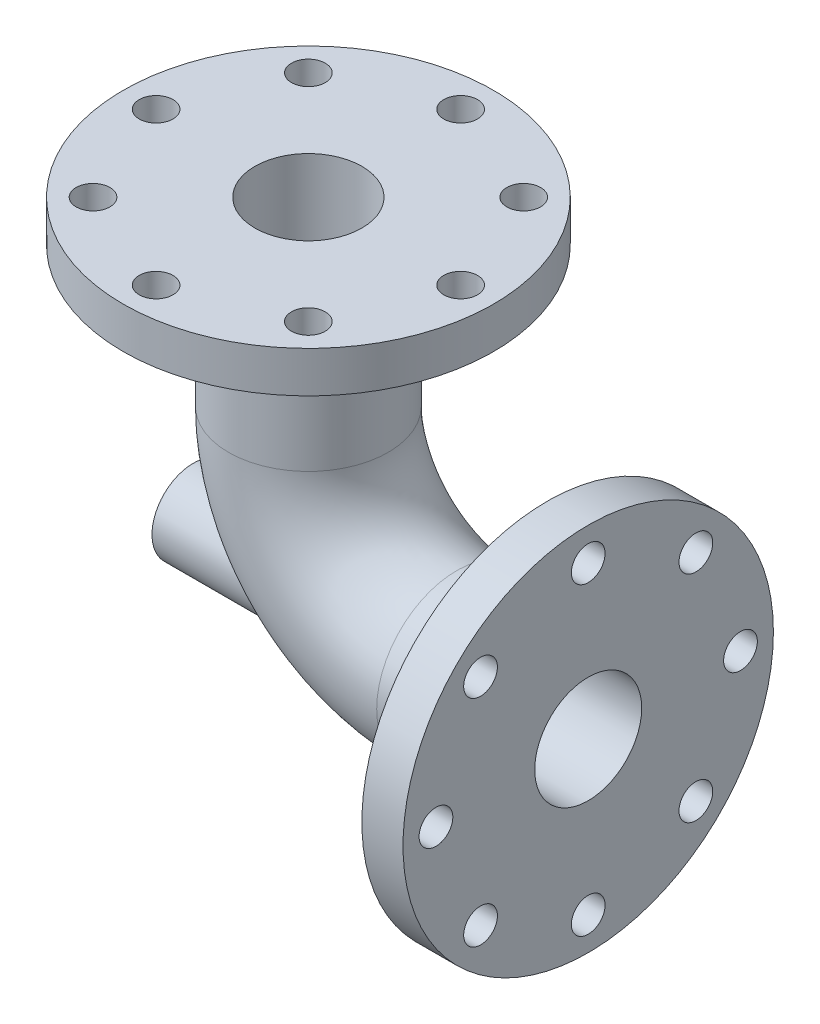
ISO-10303-21;
HEADER;
FILE_DESCRIPTION(('STEP AP214'),'2;1');
FILE_NAME('part.step','',(''),(''),'','','');
FILE_SCHEMA(('AUTOMOTIVE_DESIGN { 1 0 10303 214 1 1 1 1 }'));
ENDSEC;
DATA;
#1=APPLICATION_CONTEXT('core data for automotive mechanical design processes');
#2=APPLICATION_PROTOCOL_DEFINITION('international standard','automotive_design',2000,#1);
#3=PRODUCT_CONTEXT('',#1,'mechanical');
#4=PRODUCT('Part','Part','',(#3));
#5=PRODUCT_RELATED_PRODUCT_CATEGORY('part','',(#4));
#6=PRODUCT_DEFINITION_FORMATION('','',#4);
#7=PRODUCT_DEFINITION_CONTEXT('part definition',#1,'design');
#8=PRODUCT_DEFINITION('design','',#6,#7);
#9=PRODUCT_DEFINITION_SHAPE('','',#8);
#10=(LENGTH_UNIT() NAMED_UNIT(*) SI_UNIT(.MILLI.,.METRE.));
#11=(NAMED_UNIT(*) PLANE_ANGLE_UNIT() SI_UNIT($,.RADIAN.));
#12=(NAMED_UNIT(*) SI_UNIT($,.STERADIAN.) SOLID_ANGLE_UNIT());
#13=UNCERTAINTY_MEASURE_WITH_UNIT(LENGTH_MEASURE(1.E-05),#10,'distance_accuracy_value','');
#14=(GEOMETRIC_REPRESENTATION_CONTEXT(3) GLOBAL_UNCERTAINTY_ASSIGNED_CONTEXT((#13)) GLOBAL_UNIT_ASSIGNED_CONTEXT((#10,
#11,#12)) REPRESENTATION_CONTEXT('',''));
#15=CARTESIAN_POINT('',(0.,0.,0.));
#16=DIRECTION('',(0.,0.,1.));
#17=DIRECTION('',(1.,0.,0.));
#18=AXIS2_PLACEMENT_3D('',#15,#16,#17);
#19=CARTESIAN_POINT('',(90.,90.,0.));
#20=DIRECTION('',(0.,0.,1.));
#21=DIRECTION('',(1.,0.,0.));
#22=AXIS2_PLACEMENT_3D('',#19,#20,#21);
#23=TOROIDAL_SURFACE('',#22,90.,48.5);
#24=CARTESIAN_POINT('',(90.0000000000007,-1.05085693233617E-12,0.));
#25=DIRECTION('',(-1.,0.,0.));
#26=DIRECTION('',(0.,0.,1.));
#27=AXIS2_PLACEMENT_3D('',#24,#25,#26);
#28=CIRCLE('',#27,48.5);
#29=CARTESIAN_POINT('',(90.0000000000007,-1.05085693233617E-12,48.5));
#30=VERTEX_POINT('',#29);
#31=EDGE_CURVE('E62',#30,#30,#28,.T.);
#32=ORIENTED_EDGE('',*,*,#31,.T.);
#33=EDGE_LOOP('',(#32));
#34=FACE_BOUND('',#33,.T.);
#35=CARTESIAN_POINT('',(0.,90.0000000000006,0.));
#36=DIRECTION('',(0.,1.,0.));
#37=DIRECTION('',(0.,0.,1.));
#38=AXIS2_PLACEMENT_3D('',#35,#36,#37);
#39=CIRCLE('',#38,48.5);
#40=CARTESIAN_POINT('',(0.,90.0000000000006,48.5));
#41=VERTEX_POINT('',#40);
#42=EDGE_CURVE('E66',#41,#41,#39,.T.);
#43=ORIENTED_EDGE('',*,*,#42,.F.);
#44=EDGE_LOOP('',(#43));
#45=FACE_BOUND('',#44,.T.);
#46=CARTESIAN_POINT('',(0.155070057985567,-6.87591994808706,-24.0358425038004));
#47=CARTESIAN_POINT('',(0.717466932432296,-7.54686853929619,-23.8439036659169));
#48=CARTESIAN_POINT('',(1.26957468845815,-8.21791772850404,-23.6215535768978));
#49=CARTESIAN_POINT('',(2.34929979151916,-9.55565631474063,-23.1128027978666));
#50=CARTESIAN_POINT('',(2.87691357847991,-10.222345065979,-22.8263928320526));
#51=CARTESIAN_POINT('',(3.90344172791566,-11.5453961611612,-22.1865546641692));
#52=CARTESIAN_POINT('',(4.40236944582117,-12.2017632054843,-21.8331579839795));
#53=CARTESIAN_POINT('',(5.12610109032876,-13.1731239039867,-21.2511488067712));
#54=CARTESIAN_POINT('',(5.36322165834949,-13.4946938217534,-21.048506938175));
#55=CARTESIAN_POINT('',(5.82888081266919,-14.1326030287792,-20.6256153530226));
#56=CARTESIAN_POINT('',(6.05741719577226,-14.4489409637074,-20.4053611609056));
#57=CARTESIAN_POINT('',(6.64442320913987,-15.2696973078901,-19.8048424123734));
#58=CARTESIAN_POINT('',(6.99547999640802,-15.7689628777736,-19.4101271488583));
#59=CARTESIAN_POINT('',(7.67140049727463,-16.7455833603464,-18.5741364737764));
#60=CARTESIAN_POINT('',(7.9962692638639,-17.2229424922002,-18.1328700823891));
#61=CARTESIAN_POINT('',(8.61793849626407,-18.150413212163,-17.204443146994));
#62=CARTESIAN_POINT('',(8.91474515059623,-18.6005307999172,-16.717292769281));
#63=CARTESIAN_POINT('',(9.47862929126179,-19.4680105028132,-15.6985392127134));
#64=CARTESIAN_POINT('',(9.74570627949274,-19.8853720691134,-15.1669352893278));
#65=CARTESIAN_POINT('',(10.2501425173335,-20.6840980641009,-14.0583638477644));
#66=CARTESIAN_POINT('',(10.4873106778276,-21.0652275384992,-13.4811395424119));
#67=CARTESIAN_POINT('',(10.928710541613,-21.7829839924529,-12.2876549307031));
#68=CARTESIAN_POINT('',(11.1329415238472,-22.1196099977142,-11.6713937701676));
#69=CARTESIAN_POINT('',(11.5073589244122,-22.7430405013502,-10.4044434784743));
#70=CARTESIAN_POINT('',(11.6775533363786,-23.0298566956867,-9.75376247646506));
#71=CARTESIAN_POINT('',(11.9831257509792,-23.5490911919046,-8.42319034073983));
#72=CARTESIAN_POINT('',(12.1185077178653,-23.7815156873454,-7.74330254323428));
#73=CARTESIAN_POINT('',(12.3413458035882,-24.1664795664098,-6.43398877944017));
#74=CARTESIAN_POINT('',(12.4323676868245,-24.3248860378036,-5.80688626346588));
#75=CARTESIAN_POINT('',(12.585847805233,-24.5930429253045,-4.53894506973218));
#76=CARTESIAN_POINT('',(12.6483081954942,-24.7027970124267,-3.89810743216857));
#77=CARTESIAN_POINT('',(12.7444577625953,-24.8721111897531,-2.6079264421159));
#78=CARTESIAN_POINT('',(12.7781567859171,-24.9316884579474,-1.95858607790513));
#79=CARTESIAN_POINT('',(12.8167190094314,-24.9998841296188,-0.656382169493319));
#80=CARTESIAN_POINT('',(12.8215829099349,-25.0085037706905,-0.0035187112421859));
#81=CARTESIAN_POINT('',(12.8029931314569,-24.9756094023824,1.2643608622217));
#82=CARTESIAN_POINT('',(12.7810906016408,-24.9368415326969,1.87947334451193));
#83=CARTESIAN_POINT('',(12.7116025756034,-24.814218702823,3.10369888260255));
#84=CARTESIAN_POINT('',(12.6640183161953,-24.7303659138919,3.71281222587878));
#85=CARTESIAN_POINT('',(12.5433050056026,-24.5186227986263,4.92067552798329));
#86=CARTESIAN_POINT('',(12.4701791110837,-24.3907379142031,5.51942675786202));
#87=CARTESIAN_POINT('',(12.2985899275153,-24.0924909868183,6.70254179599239));
#88=CARTESIAN_POINT('',(12.2001262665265,-23.9221283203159,7.28690539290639));
#89=CARTESIAN_POINT('',(11.9780007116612,-23.5407029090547,8.43822266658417));
#90=CARTESIAN_POINT('',(11.8543025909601,-23.3295816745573,9.00514994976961));
#91=CARTESIAN_POINT('',(11.5822002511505,-22.8692972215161,10.1171822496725));
#92=CARTESIAN_POINT('',(11.4337962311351,-22.6201343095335,10.6622874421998));
#93=CARTESIAN_POINT('',(11.1127851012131,-22.0866104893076,11.7275979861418));
#94=CARTESIAN_POINT('',(10.9401763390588,-21.802247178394,12.2478016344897));
#95=CARTESIAN_POINT('',(10.571398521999,-21.2014854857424,13.2606082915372));
#96=CARTESIAN_POINT('',(10.3752287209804,-20.8850860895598,13.7532104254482));
#97=CARTESIAN_POINT('',(9.94937183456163,-20.2065252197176,14.7332842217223));
#98=CARTESIAN_POINT('',(9.71847747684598,-19.8428447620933,15.2191791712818));
#99=CARTESIAN_POINT('',(9.23251246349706,-19.0877892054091,16.1560616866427));
#100=CARTESIAN_POINT('',(8.97744117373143,-18.6964133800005,16.6070483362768));
#101=CARTESIAN_POINT('',(8.44427677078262,-17.8899656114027,17.4728118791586));
#102=CARTESIAN_POINT('',(8.16618133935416,-17.4748912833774,17.8875851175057));
#103=CARTESIAN_POINT('',(7.58827202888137,-16.6249801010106,18.6801434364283));
#104=CARTESIAN_POINT('',(7.28845539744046,-16.1901407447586,19.0579238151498));
#105=CARTESIAN_POINT('',(6.63363468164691,-15.2546214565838,19.8166313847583));
#106=CARTESIAN_POINT('',(6.27621686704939,-14.7520386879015,20.1931292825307));
#107=CARTESIAN_POINT('',(5.5383152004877,-13.7318475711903,20.9002792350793));
#108=CARTESIAN_POINT('',(5.15783023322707,-13.2142384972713,21.2309290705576));
#109=CARTESIAN_POINT('',(4.37570641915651,-12.1679704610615,21.8474119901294));
#110=CARTESIAN_POINT('',(3.97405614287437,-11.6393056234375,22.1332205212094));
#111=CARTESIAN_POINT('',(3.15183426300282,-10.5747841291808,22.6611342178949));
#112=CARTESIAN_POINT('',(2.73125908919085,-10.0389261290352,22.9032310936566));
#113=CARTESIAN_POINT('',(1.97845619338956,-9.09501765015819,23.2910591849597));
#114=CARTESIAN_POINT('',(1.64981293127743,-8.68780153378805,23.4458710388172));
#115=CARTESIAN_POINT('',(0.983938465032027,-7.87233368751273,23.7321102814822));
#116=CARTESIAN_POINT('',(0.646708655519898,-7.464082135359,23.8635414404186));
#117=CARTESIAN_POINT('',(-0.376965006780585,-6.23881705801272,24.2240039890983));
#118=CARTESIAN_POINT('',(-1.0752340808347,-5.42149245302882,24.4191236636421));
#119=CARTESIAN_POINT('',(-2.49737779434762,-3.79152703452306,24.7247495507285));
#120=CARTESIAN_POINT('',(-3.22129040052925,-2.97889543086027,24.8351243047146));
#121=CARTESIAN_POINT('',(-4.68768790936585,-1.36379867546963,24.9759287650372));
#122=CARTESIAN_POINT('',(-5.43017096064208,-0.561332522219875,25.006366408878));
#123=CARTESIAN_POINT('',(-6.94398344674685,1.04733836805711,24.9912743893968));
#124=CARTESIAN_POINT('',(-7.71559088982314,1.85326364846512,24.9441255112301));
#125=CARTESIAN_POINT('',(-9.26680880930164,3.44923195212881,24.7739148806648));
#126=CARTESIAN_POINT('',(-10.0464196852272,4.23927417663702,24.6508493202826));
#127=CARTESIAN_POINT('',(-11.6083151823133,5.80169623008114,24.3305646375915));
#128=CARTESIAN_POINT('',(-12.390600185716,6.57407340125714,24.1333344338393));
#129=CARTESIAN_POINT('',(-13.9522514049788,8.09914969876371,23.6651647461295));
#130=CARTESIAN_POINT('',(-14.7316177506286,8.85184970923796,23.3942285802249));
#131=CARTESIAN_POINT('',(-16.2785374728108,10.3323109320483,22.779010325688));
#132=CARTESIAN_POINT('',(-17.0461262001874,11.060161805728,22.4350337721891));
#133=CARTESIAN_POINT('',(-18.5665673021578,12.4912828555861,21.6708553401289));
#134=CARTESIAN_POINT('',(-19.3194174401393,13.1945493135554,21.2506419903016));
#135=CARTESIAN_POINT('',(-20.8019456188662,14.5713163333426,20.3312856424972));
#136=CARTESIAN_POINT('',(-21.5316514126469,15.2448529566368,19.8322418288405));
#137=CARTESIAN_POINT('',(-22.959739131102,16.5570329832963,18.750656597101));
#138=CARTESIAN_POINT('',(-23.6581362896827,17.1956933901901,18.1681563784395));
#139=CARTESIAN_POINT('',(-24.7767041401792,18.2151157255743,17.1329552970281));
#140=CARTESIAN_POINT('',(-25.2091299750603,18.6082918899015,16.7056127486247));
#141=CARTESIAN_POINT('',(-26.0521360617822,19.3733893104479,15.8119500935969));
#142=CARTESIAN_POINT('',(-26.4627174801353,19.7453117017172,15.3456320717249));
#143=CARTESIAN_POINT('',(-27.2569884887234,20.463763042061,14.3735588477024));
#144=CARTESIAN_POINT('',(-27.6407134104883,20.8103253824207,13.8678573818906));
#145=CARTESIAN_POINT('',(-28.3767034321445,21.4743027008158,12.8156623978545));
#146=CARTESIAN_POINT('',(-28.728965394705,21.7917147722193,12.2691648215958));
#147=CARTESIAN_POINT('',(-29.3230148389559,22.3265534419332,11.2594986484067));
#148=CARTESIAN_POINT('',(-29.5721316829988,22.5506804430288,10.8041833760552));
#149=CARTESIAN_POINT('',(-30.0440508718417,22.9750455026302,9.86967154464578));
#150=CARTESIAN_POINT('',(-30.2668677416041,23.1752967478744,9.39048837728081));
#151=CARTESIAN_POINT('',(-30.6829014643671,23.549055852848,8.40936763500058));
#152=CARTESIAN_POINT('',(-30.8761218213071,23.7225668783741,7.90743276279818));
#153=CARTESIAN_POINT('',(-31.2295292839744,24.0398391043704,6.88285373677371));
#154=CARTESIAN_POINT('',(-31.3897161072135,24.183600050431,6.36020940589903));
#155=CARTESIAN_POINT('',(-31.675149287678,24.4397172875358,5.29195946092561));
#156=CARTESIAN_POINT('',(-31.8000302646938,24.5517451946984,4.74617651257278));
#157=CARTESIAN_POINT('',(-32.0097078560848,24.7398211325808,3.6408067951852));
#158=CARTESIAN_POINT('',(-32.0945043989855,24.8158690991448,3.08122000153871));
#159=CARTESIAN_POINT('',(-32.22173381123,24.9299661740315,1.95384436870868));
#160=CARTESIAN_POINT('',(-32.2642008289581,24.9680459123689,1.38606251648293));
#161=CARTESIAN_POINT('',(-32.3056978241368,25.0052559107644,0.247677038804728));
#162=CARTESIAN_POINT('',(-32.3047342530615,25.0043919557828,-0.322926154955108));
#163=CARTESIAN_POINT('',(-32.2628739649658,24.9668560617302,-1.3746434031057));
#164=CARTESIAN_POINT('',(-32.2280514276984,24.9356308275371,-1.85621388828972));
#165=CARTESIAN_POINT('',(-32.1279082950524,24.8458257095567,-2.81353825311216));
#166=CARTESIAN_POINT('',(-32.0625915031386,24.7872492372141,-3.28929285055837));
#167=CARTESIAN_POINT('',(-31.9026966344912,24.6438370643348,-4.23185779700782));
#168=CARTESIAN_POINT('',(-31.8081152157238,24.5589983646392,-4.69866711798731));
#169=CARTESIAN_POINT('',(-31.5913740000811,24.364549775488,-5.62055947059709));
#170=CARTESIAN_POINT('',(-31.4692125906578,24.2549384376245,-6.07564181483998));
#171=CARTESIAN_POINT('',(-31.1975663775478,24.0111427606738,-6.97753560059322));
#172=CARTESIAN_POINT('',(-31.0477536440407,23.8766634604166,-7.42416808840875));
#173=CARTESIAN_POINT('',(-30.724114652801,23.5860595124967,-8.30128669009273));
#174=CARTESIAN_POINT('',(-30.5502890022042,23.4299354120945,-8.73177321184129));
#175=CARTESIAN_POINT('',(-29.9961300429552,22.9320147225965,-9.99720214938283));
#176=CARTESIAN_POINT('',(-29.5830490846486,22.5606108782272,-10.8063262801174));
#177=CARTESIAN_POINT('',(-28.4230152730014,21.5163418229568,-12.8048196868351));
#178=CARTESIAN_POINT('',(-27.622625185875,20.7946806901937,-13.9378008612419));
#179=CARTESIAN_POINT('',(-26.3329545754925,19.6278275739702,-15.4975033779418));
#180=CARTESIAN_POINT('',(-25.8873743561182,19.224049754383,-15.9948427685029));
#181=CARTESIAN_POINT('',(-24.971382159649,18.3922113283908,-16.9447519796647));
#182=CARTESIAN_POINT('',(-24.5009705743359,17.9641511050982,-17.3973225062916));
#183=CARTESIAN_POINT('',(-23.6706795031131,17.2066103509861,-18.1420261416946));
#184=CARTESIAN_POINT('',(-23.3154624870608,16.8819157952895,-18.4443598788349));
#185=CARTESIAN_POINT('',(-22.5959117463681,16.222735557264,-19.0267230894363));
#186=CARTESIAN_POINT('',(-22.2315774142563,15.8882492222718,-19.3067510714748));
#187=CARTESIAN_POINT('',(-21.1267501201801,14.8713663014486,-20.1144870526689));
#188=CARTESIAN_POINT('',(-20.3745563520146,14.1756582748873,-20.6097376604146));
#189=CARTESIAN_POINT('',(-18.8477306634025,12.7542409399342,-21.5184064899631));
#190=CARTESIAN_POINT('',(-18.0730707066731,12.0284936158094,-21.9317169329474));
#191=CARTESIAN_POINT('',(-16.5098299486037,10.551988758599,-22.6790644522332));
#192=CARTESIAN_POINT('',(-15.7212512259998,9.80123494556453,-23.0131132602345));
#193=CARTESIAN_POINT('',(-14.1073864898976,8.24946796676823,-23.6149152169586));
#194=CARTESIAN_POINT('',(-13.2818203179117,7.44762260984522,-23.8797646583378));
#195=CARTESIAN_POINT('',(-11.6292235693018,5.82251681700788,-24.3271165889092));
#196=CARTESIAN_POINT('',(-10.8021927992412,4.99925331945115,-24.509607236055));
#197=CARTESIAN_POINT('',(-9.15499724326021,3.33541243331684,-24.7908324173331));
#198=CARTESIAN_POINT('',(-8.33482141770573,2.49487671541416,-24.8897487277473));
#199=CARTESIAN_POINT('',(-6.7061053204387,0.797234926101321,-25.0017535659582));
#200=CARTESIAN_POINT('',(-5.89756106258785,-0.0598652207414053,-25.0148722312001));
#201=CARTESIAN_POINT('',(-4.64529915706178,-1.41312424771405,-24.9648320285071));
#202=CARTESIAN_POINT('',(-4.19530112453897,-1.90476426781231,-24.932260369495));
#203=CARTESIAN_POINT('',(-3.30248692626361,-2.89162161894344,-24.8371547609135));
#204=CARTESIAN_POINT('',(-2.8596699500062,-3.38683853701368,-24.774624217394));
#205=CARTESIAN_POINT('',(-1.9822842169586,-4.38024938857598,-24.618415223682));
#206=CARTESIAN_POINT('',(-1.5477207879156,-4.8784449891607,-24.5247173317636));
#207=CARTESIAN_POINT('',(-0.688510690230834,-5.87638161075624,-24.3049222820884));
#208=CARTESIAN_POINT('',(-0.263865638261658,-6.37612286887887,-24.1788198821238));
#209=CARTESIAN_POINT('',(0.155070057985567,-6.87591994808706,-24.0358425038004));
#210=B_SPLINE_CURVE_WITH_KNOTS('',3,(#46,#47,#48,#49,#50,#51,#52,#53,#54,#55,#56,#57,#58,#59,
#60,#61,#62,#63,#64,#65,#66,#67,#68,#69,#70,#71,#72,#73,#74,#75,#76,#77,#78,#79,#80,#81,#82,#83,
#84,#85,#86,#87,#88,#89,#90,#91,#92,#93,#94,#95,#96,#97,#98,#99,#100,#101,#102,#103,#104,#105,
#106,#107,#108,#109,#110,#111,#112,#113,#114,#115,#116,#117,#118,#119,#120,#121,#122,#123,#124,
#125,#126,#127,#128,#129,#130,#131,#132,#133,#134,#135,#136,#137,#138,#139,#140,#141,#142,#143,
#144,#145,#146,#147,#148,#149,#150,#151,#152,#153,#154,#155,#156,#157,#158,#159,#160,#161,#162,
#163,#164,#165,#166,#167,#168,#169,#170,#171,#172,#173,#174,#175,#176,#177,#178,#179,#180,#181,
#182,#183,#184,#185,#186,#187,#188,#189,#190,#191,#192,#193,#194,#195,#196,#197,#198,#199,#200,
#201,#202,#203,#204,#205,#206,#207,#208,#209),.UNSPECIFIED.,.T.,.F.,(4,2,2,2,2,2,2,2,2,2,2,2,2,
2,2,2,2,2,2,2,2,2,2,2,2,2,2,2,2,2,2,2,2,2,2,2,2,2,2,2,2,2,2,2,2,2,2,2,2,2,2,2,2,2,2,2,2,2,2,2,2,
2,2,2,2,2,2,2,2,2,2,2,2,2,2,2,2,2,2,2,2,4),(0.,2.68836013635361,5.37710979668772,
8.06459734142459,9.40818183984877,10.7521088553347,12.9303384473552,15.1081467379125,
17.2854736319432,19.4628370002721,21.6534738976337,23.8441587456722,26.0343284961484,
28.2242487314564,30.1812636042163,32.138130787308,34.0943277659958,36.0504772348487,
37.8984473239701,39.7463284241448,41.593981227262,43.4416611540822,45.2920125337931,
47.1423490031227,48.9928118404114,50.8433332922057,52.7893548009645,54.7354273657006,
56.6816961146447,58.6282119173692,60.7937589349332,62.9594107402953,65.126244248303,
67.2934882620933,68.9300418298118,70.5663312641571,73.8397097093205,77.1181557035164,
80.3962761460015,83.7436817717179,87.091255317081,90.43932924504,93.7872524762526,
97.1214375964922,100.456124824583,103.786649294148,107.115535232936,109.286145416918,
111.456639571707,113.624222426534,115.792021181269,117.486578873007,119.180196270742,
120.873613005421,122.567044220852,124.277407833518,125.987774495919,127.696760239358,
129.40549211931,130.855258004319,132.304843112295,133.754593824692,135.204429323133,
136.672715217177,138.140963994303,141.076778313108,145.73999390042,148.079653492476,
150.419276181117,152.123742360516,153.828322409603,157.238079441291,160.65229211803,
164.0659991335,167.60576776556,171.146045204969,174.678602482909,178.209918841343,
180.211161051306,182.212175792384,184.214441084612,186.217030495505),.UNSPECIFIED.);
#211=CARTESIAN_POINT('',(0.155070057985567,-6.87591994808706,-24.0358425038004));
#212=VERTEX_POINT('',#211);
#213=EDGE_CURVE('E11',#212,#212,#210,.T.);
#214=ORIENTED_EDGE('',*,*,#213,.F.);
#215=EDGE_LOOP('',(#214));
#216=FACE_BOUND('',#215,.T.);
#217=ADVANCED_FACE('F49',(#34,#45,#216),#23,.T.);
#218=CARTESIAN_POINT('',(0.,175.,0.));
#219=DIRECTION('',(0.,-1.,0.));
#220=DIRECTION('',(0.,0.,-1.));
#221=AXIS2_PLACEMENT_3D('',#218,#219,#220);
#222=CYLINDRICAL_SURFACE('',#221,48.5);
#223=ORIENTED_EDGE('',*,*,#42,.T.);
#224=EDGE_LOOP('',(#223));
#225=FACE_BOUND('',#224,.T.);
#226=CARTESIAN_POINT('',(0.,175.,0.));
#227=DIRECTION('',(0.,1.,0.));
#228=DIRECTION('',(0.,0.,1.));
#229=AXIS2_PLACEMENT_3D('',#226,#227,#228);
#230=CIRCLE('',#229,48.5);
#231=CARTESIAN_POINT('',(0.,175.,48.5));
#232=VERTEX_POINT('',#231);
#233=EDGE_CURVE('E197',#232,#232,#230,.T.);
#234=ORIENTED_EDGE('',*,*,#233,.F.);
#235=EDGE_LOOP('',(#234));
#236=FACE_BOUND('',#235,.T.);
#237=ADVANCED_FACE('F183',(#225,#236),#222,.T.);
#238=CARTESIAN_POINT('',(90.0000000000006,0.,0.));
#239=DIRECTION('',(1.,0.,0.));
#240=DIRECTION('',(0.,0.,-1.));
#241=AXIS2_PLACEMENT_3D('',#238,#239,#240);
#242=CYLINDRICAL_SURFACE('',#241,48.5);
#243=CARTESIAN_POINT('',(145.,0.,0.));
#244=DIRECTION('',(-1.,0.,0.));
#245=DIRECTION('',(0.,0.,1.));
#246=AXIS2_PLACEMENT_3D('',#243,#244,#245);
#247=CIRCLE('',#246,48.5);
#248=CARTESIAN_POINT('',(145.,0.,48.5));
#249=VERTEX_POINT('',#248);
#250=EDGE_CURVE('E73',#249,#249,#247,.T.);
#251=ORIENTED_EDGE('',*,*,#250,.T.);
#252=EDGE_LOOP('',(#251));
#253=FACE_BOUND('',#252,.T.);
#254=ORIENTED_EDGE('',*,*,#31,.F.);
#255=EDGE_LOOP('',(#254));
#256=FACE_BOUND('',#255,.T.);
#257=ADVANCED_FACE('F51',(#253,#256),#242,.T.);
#258=CARTESIAN_POINT('',(0.,175.,0.));
#259=DIRECTION('',(0.,-1.,0.));
#260=DIRECTION('',(0.,0.,-1.));
#261=AXIS2_PLACEMENT_3D('',#258,#259,#260);
#262=CYLINDRICAL_SURFACE('',#261,32.5);
#263=CARTESIAN_POINT('',(0.,90.0000000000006,0.));
#264=DIRECTION('',(0.,-1.,0.));
#265=DIRECTION('',(0.,0.,-1.));
#266=AXIS2_PLACEMENT_3D('',#263,#264,#265);
#267=CIRCLE('',#266,32.5);
#268=CARTESIAN_POINT('',(0.,90.0000000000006,-32.5));
#269=VERTEX_POINT('',#268);
#270=EDGE_CURVE('E203',#269,#269,#267,.F.);
#271=ORIENTED_EDGE('',*,*,#270,.F.);
#272=EDGE_LOOP('',(#271));
#273=FACE_BOUND('',#272,.T.);
#274=CARTESIAN_POINT('',(0.,200.,0.));
#275=DIRECTION('',(0.,1.,0.));
#276=DIRECTION('',(0.,0.,1.));
#277=AXIS2_PLACEMENT_3D('',#274,#275,#276);
#278=CIRCLE('',#277,32.5);
#279=CARTESIAN_POINT('',(0.,200.,32.5));
#280=VERTEX_POINT('',#279);
#281=EDGE_CURVE('E212',#280,#280,#278,.T.);
#282=ORIENTED_EDGE('',*,*,#281,.T.);
#283=EDGE_LOOP('',(#282));
#284=FACE_BOUND('',#283,.T.);
#285=ADVANCED_FACE('F167',(#273,#284),#262,.F.);
#286=CARTESIAN_POINT('',(90.,90.,0.));
#287=DIRECTION('',(0.,0.,1.));
#288=DIRECTION('',(1.,0.,0.));
#289=AXIS2_PLACEMENT_3D('',#286,#287,#288);
#290=TOROIDAL_SURFACE('',#289,90.,32.5);
#291=CARTESIAN_POINT('',(-1.55503250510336,9.03875048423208,-4.27796560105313));
#292=CARTESIAN_POINT('',(-1.7414521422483,9.18684291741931,-3.96503310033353));
#293=CARTESIAN_POINT('',(-1.9124105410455,9.32236996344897,-3.63661544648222));
#294=CARTESIAN_POINT('',(-2.13898067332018,9.50175106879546,-3.1224657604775));
#295=CARTESIAN_POINT('',(-2.20956256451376,9.55758858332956,-2.94737357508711));
#296=CARTESIAN_POINT('',(-2.33958622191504,9.66039232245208,-2.5906052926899));
#297=CARTESIAN_POINT('',(-2.39903274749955,9.70736233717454,-2.40893204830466));
#298=CARTESIAN_POINT('',(-2.50613906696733,9.7919519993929,-2.03817298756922));
#299=CARTESIAN_POINT('',(-2.55369009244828,9.82948537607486,-1.84903586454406));
#300=CARTESIAN_POINT('',(-2.63526598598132,9.89385531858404,-1.46605566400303));
#301=CARTESIAN_POINT('',(-2.66929088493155,9.92069190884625,-1.27221259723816));
#302=CARTESIAN_POINT('',(-2.72295327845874,9.96300964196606,-0.881484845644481));
#303=CARTESIAN_POINT('',(-2.74260362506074,9.97850092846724,-0.684603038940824));
#304=CARTESIAN_POINT('',(-2.76704741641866,9.99777028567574,-0.289351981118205));
#305=CARTESIAN_POINT('',(-2.77184214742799,10.0015493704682,-0.0909828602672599));
#306=CARTESIAN_POINT('',(-2.7666868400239,9.99748569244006,0.288188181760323));
#307=CARTESIAN_POINT('',(-2.75798119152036,9.99062376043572,0.469019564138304));
#308=CARTESIAN_POINT('',(-2.72828069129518,9.96720884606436,0.82902421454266));
#309=CARTESIAN_POINT('',(-2.70728657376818,9.95065644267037,1.0081975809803));
#310=CARTESIAN_POINT('',(-2.65345402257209,9.90820046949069,1.36367976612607));
#311=CARTESIAN_POINT('',(-2.62061169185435,9.88229382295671,1.53998762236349));
#312=CARTESIAN_POINT('',(-2.54374650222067,9.8216364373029,1.88858821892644));
#313=CARTESIAN_POINT('',(-2.4997231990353,9.78688534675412,2.06088079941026));
#314=CARTESIAN_POINT('',(-2.40147275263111,9.70928894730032,2.39996982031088));
#315=CARTESIAN_POINT('',(-2.34728156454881,9.6664721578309,2.56678326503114));
#316=CARTESIAN_POINT('',(-2.22946273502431,9.5733263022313,2.89491566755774));
#317=CARTESIAN_POINT('',(-2.16583214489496,9.52299488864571,3.0562328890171));
#318=CARTESIAN_POINT('',(-1.96216364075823,9.36178180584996,3.53110792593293));
#319=CARTESIAN_POINT('',(-1.80930375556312,9.24064561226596,3.83574073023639));
#320=CARTESIAN_POINT('',(-1.36977724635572,8.89169016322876,4.60585715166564));
#321=CARTESIAN_POINT('',(-1.06002883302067,8.64516664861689,5.04971859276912));
#322=CARTESIAN_POINT('',(-0.558782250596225,8.24462528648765,5.66447943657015));
#323=CARTESIAN_POINT('',(-0.385250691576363,8.10570770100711,5.86120217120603));
#324=CARTESIAN_POINT('',(-0.0279841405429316,7.81909004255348,6.2384183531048));
#325=CARTESIAN_POINT('',(0.15575053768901,7.67139023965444,6.41891229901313));
#326=CARTESIAN_POINT('',(0.633215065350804,7.28665882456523,6.85784635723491));
#327=CARTESIAN_POINT('',(0.932660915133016,7.04454011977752,7.10560740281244));
#328=CARTESIAN_POINT('',(1.54608016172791,6.54647088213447,7.56696633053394));
#329=CARTESIAN_POINT('',(1.86006120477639,6.29051305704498,7.78054596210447));
#330=CARTESIAN_POINT('',(2.49907798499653,5.76712690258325,8.17606140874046));
#331=CARTESIAN_POINT('',(2.82412930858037,5.49968224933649,8.3579501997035));
#332=CARTESIAN_POINT('',(3.48184291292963,4.95568829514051,8.69154324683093));
#333=CARTESIAN_POINT('',(3.81450467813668,4.67913961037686,8.84324954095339));
#334=CARTESIAN_POINT('',(4.60781727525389,4.01581982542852,9.16815710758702));
#335=CARTESIAN_POINT('',(5.07079688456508,3.62571530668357,9.32893988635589));
#336=CARTESIAN_POINT('',(6.00204236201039,2.83400273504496,9.59913563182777));
#337=CARTESIAN_POINT('',(6.4703102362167,2.43239022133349,9.70852838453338));
#338=CARTESIAN_POINT('',(7.40814204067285,1.61998513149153,9.87662553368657));
#339=CARTESIAN_POINT('',(7.87770621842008,1.20919067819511,9.93531946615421));
#340=CARTESIAN_POINT('',(8.81425190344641,0.380780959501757,10.0013801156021));
#341=CARTESIAN_POINT('',(9.28123414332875,-0.0368322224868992,10.0087622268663));
#342=CARTESIAN_POINT('',(10.1280675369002,-0.803287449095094,9.97371978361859));
#343=CARTESIAN_POINT('',(10.5089163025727,-1.15142678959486,9.93975362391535));
#344=CARTESIAN_POINT('',(11.2641423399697,-1.84910995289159,9.83388486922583));
#345=CARTESIAN_POINT('',(11.638519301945,-2.19865384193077,9.76198046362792));
#346=CARTESIAN_POINT('',(12.3775018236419,-2.89632442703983,9.57816422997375));
#347=CARTESIAN_POINT('',(12.7421230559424,-3.24445252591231,9.46632130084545));
#348=CARTESIAN_POINT('',(13.4590950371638,-3.93693661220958,9.19989551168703));
#349=CARTESIAN_POINT('',(13.8114506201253,-4.28129404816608,9.0453297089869));
#350=CARTESIAN_POINT('',(14.3941604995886,-4.8575254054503,8.74500356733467));
#351=CARTESIAN_POINT('',(14.628700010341,-5.09141348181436,8.61116232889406));
#352=CARTESIAN_POINT('',(15.0886332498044,-5.55385908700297,8.32041089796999));
#353=CARTESIAN_POINT('',(15.3140274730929,-5.78241690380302,8.16350195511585));
#354=CARTESIAN_POINT('',(15.7536792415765,-6.23190077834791,7.82574977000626));
#355=CARTESIAN_POINT('',(15.9679484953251,-6.4528347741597,7.64493243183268));
#356=CARTESIAN_POINT('',(16.3836335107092,-6.88489156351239,7.25825703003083));
#357=CARTESIAN_POINT('',(16.5850478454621,-7.09601326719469,7.05239619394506));
#358=CARTESIAN_POINT('',(16.9296329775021,-7.45998734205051,6.66355261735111));
#359=CARTESIAN_POINT('',(17.0758180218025,-7.61538273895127,6.4856130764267));
#360=CARTESIAN_POINT('',(17.3576832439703,-7.91672887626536,6.11412933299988));
#361=CARTESIAN_POINT('',(17.493365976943,-8.06268191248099,5.92058894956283));
#362=CARTESIAN_POINT('',(17.7527993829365,-8.34325411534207,5.51817248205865));
#363=CARTESIAN_POINT('',(17.8765594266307,-8.47788217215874,5.30930867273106));
#364=CARTESIAN_POINT('',(18.1108169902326,-8.73396229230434,4.87658402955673));
#365=CARTESIAN_POINT('',(18.2213166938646,-8.85541652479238,4.65272567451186));
#366=CARTESIAN_POINT('',(18.4102403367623,-9.0639704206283,4.22969713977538));
#367=CARTESIAN_POINT('',(18.4909346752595,-9.15341425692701,4.03269337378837));
#368=CARTESIAN_POINT('',(18.6412500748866,-9.32055995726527,3.62970029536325));
#369=CARTESIAN_POINT('',(18.7108732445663,-9.39826405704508,3.42371270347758));
#370=CARTESIAN_POINT('',(18.8382213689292,-9.5407741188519,3.00379326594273));
#371=CARTESIAN_POINT('',(18.895949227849,-9.60558322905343,2.78986337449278));
#372=CARTESIAN_POINT('',(18.9987824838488,-9.72127486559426,2.35528542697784));
#373=CARTESIAN_POINT('',(19.0438876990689,-9.77215719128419,2.13463727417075));
#374=CARTESIAN_POINT('',(19.1210302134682,-9.85931118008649,1.68707055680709));
#375=CARTESIAN_POINT('',(19.1530030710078,-9.89551078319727,1.46012677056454));
#376=CARTESIAN_POINT('',(19.2030863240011,-9.95226373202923,1.00276721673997));
#377=CARTESIAN_POINT('',(19.2211966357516,-9.97281698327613,0.772351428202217));
#378=CARTESIAN_POINT('',(19.2432708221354,-9.99787356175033,0.310015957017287));
#379=CARTESIAN_POINT('',(19.2472374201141,-10.0023799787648,0.0780965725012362));
#380=CARTESIAN_POINT('',(19.2409678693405,-9.9952606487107,-0.385292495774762));
#381=CARTESIAN_POINT('',(19.2307325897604,-9.98363588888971,-0.616762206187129));
#382=CARTESIAN_POINT('',(19.1976396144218,-9.94609421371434,-1.05841333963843));
#383=CARTESIAN_POINT('',(19.1758841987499,-9.9214256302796,-1.26878583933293));
#384=CARTESIAN_POINT('',(19.1208266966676,-9.85909405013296,-1.68604768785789));
#385=CARTESIAN_POINT('',(19.0875253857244,-9.82143192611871,-1.89293726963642));
#386=CARTESIAN_POINT('',(19.009796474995,-9.73370778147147,-2.3018822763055));
#387=CARTESIAN_POINT('',(18.9653711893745,-9.6836483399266,-2.5039386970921));
#388=CARTESIAN_POINT('',(18.8658921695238,-9.57184025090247,-2.90218367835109));
#389=CARTESIAN_POINT('',(18.8108344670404,-9.51008723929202,-3.09837001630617));
#390=CARTESIAN_POINT('',(18.6886446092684,-9.37344924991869,-3.49041578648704));
#391=CARTESIAN_POINT('',(18.6211642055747,-9.29818770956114,-3.68603506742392));
#392=CARTESIAN_POINT('',(18.4761767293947,-9.1370515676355,-4.06908922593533));
#393=CARTESIAN_POINT('',(18.3986657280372,-9.0511728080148,-4.25652085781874));
#394=CARTESIAN_POINT('',(18.2343721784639,-8.86985092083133,-4.62249420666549));
#395=CARTESIAN_POINT('',(18.1475886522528,-8.7744067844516,-4.80103498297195));
#396=CARTESIAN_POINT('',(17.9654955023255,-8.57498265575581,-5.14877335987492));
#397=CARTESIAN_POINT('',(17.8701841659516,-8.47100094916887,-5.3179690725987));
#398=CARTESIAN_POINT('',(17.6281211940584,-8.20809908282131,-5.71901765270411));
#399=CARTESIAN_POINT('',(17.4771785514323,-8.04512609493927,-5.94570877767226));
#400=CARTESIAN_POINT('',(17.1611822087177,-7.70631791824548,-6.37873893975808));
#401=CARTESIAN_POINT('',(16.996123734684,-7.53047838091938,-6.58507104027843));
#402=CARTESIAN_POINT('',(16.6535151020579,-7.16813533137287,-6.97777361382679));
#403=CARTESIAN_POINT('',(16.4759449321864,-6.98161482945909,-7.16411084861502));
#404=CARTESIAN_POINT('',(16.1102514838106,-6.60034232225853,-7.51684415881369));
#405=CARTESIAN_POINT('',(15.922127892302,-6.40559007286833,-7.68323964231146));
#406=CARTESIAN_POINT('',(15.4643275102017,-5.93522776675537,-8.05566856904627));
#407=CARTESIAN_POINT('',(15.1905772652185,-5.65674232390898,-8.25308956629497));
#408=CARTESIAN_POINT('',(14.6291393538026,-5.09153631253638,-8.61328249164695));
#409=CARTESIAN_POINT('',(14.3414466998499,-4.80481281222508,-8.77604190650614));
#410=CARTESIAN_POINT('',(13.7545900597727,-4.22591360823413,-9.06901288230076));
#411=CARTESIAN_POINT('',(13.4554142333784,-3.93373244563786,-9.19918974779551));
#412=CARTESIAN_POINT('',(12.8481912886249,-3.34660118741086,-9.42865881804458));
#413=CARTESIAN_POINT('',(12.5401441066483,-3.05165107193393,-9.52795080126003));
#414=CARTESIAN_POINT('',(11.8051419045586,-2.35463988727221,-9.72780773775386));
#415=CARTESIAN_POINT('',(11.3752108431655,-1.95215013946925,-9.81602568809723));
#416=CARTESIAN_POINT('',(10.5064748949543,-1.14878775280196,-9.94211653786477));
#417=CARTESIAN_POINT('',(10.0676668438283,-0.747915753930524,-9.9799711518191));
#418=CARTESIAN_POINT('',(9.18403975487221,0.0502122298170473,-10.0078553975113));
#419=CARTESIAN_POINT('',(8.73921218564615,0.447461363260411,-9.99780802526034));
#420=CARTESIAN_POINT('',(7.84751765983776,1.23555014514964,-9.93125297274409));
#421=CARTESIAN_POINT('',(7.40065100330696,1.62639070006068,-9.87475192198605));
#422=CARTESIAN_POINT('',(6.50037658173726,2.4064272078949,-9.71443961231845));
#423=CARTESIAN_POINT('',(6.04698648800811,2.79548272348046,-9.60984185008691));
#424=CARTESIAN_POINT('',(5.14476658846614,3.56310058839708,-9.35244752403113));
#425=CARTESIAN_POINT('',(4.69593813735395,3.94165987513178,-9.19963705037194));
#426=CARTESIAN_POINT('',(3.80767402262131,4.68523094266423,-8.84410854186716));
#427=CARTESIAN_POINT('',(3.36822683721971,5.05025980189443,-8.64145607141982));
#428=CARTESIAN_POINT('',(2.7201193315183,5.58510597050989,-8.29767416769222));
#429=CARTESIAN_POINT('',(2.50596759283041,5.76123910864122,-8.17647353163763));
#430=CARTESIAN_POINT('',(2.08216045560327,6.10874349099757,-7.92021908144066));
#431=CARTESIAN_POINT('',(1.87250434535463,6.28011549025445,-7.78516747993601));
#432=CARTESIAN_POINT('',(1.42524228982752,6.64467563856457,-7.47756652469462));
#433=CARTESIAN_POINT('',(1.18859387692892,6.83691469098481,-7.30248421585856));
#434=CARTESIAN_POINT('',(0.724682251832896,7.21265883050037,-6.93161160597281));
#435=CARTESIAN_POINT('',(0.497419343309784,7.39616363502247,-6.73582063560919));
#436=CARTESIAN_POINT('',(0.0557711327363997,7.75183870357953,-6.32320025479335));
#437=CARTESIAN_POINT('',(-0.158666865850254,7.92405567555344,-6.10646811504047));
#438=CARTESIAN_POINT('',(-0.57247040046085,8.25562272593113,-5.6501473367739));
#439=CARTESIAN_POINT('',(-0.771844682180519,8.41498027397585,-5.41057214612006));
#440=CARTESIAN_POINT('',(-1.17227731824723,8.73441317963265,-4.8801678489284));
#441=CARTESIAN_POINT('',(-1.37117453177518,8.89269304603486,-4.58659797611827));
#442=CARTESIAN_POINT('',(-1.55503250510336,9.03875048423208,-4.27796560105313));
#443=B_SPLINE_CURVE_WITH_KNOTS('',3,(#291,#292,#293,#294,#295,#296,#297,#298,#299,#300,#301,
#302,#303,#304,#305,#306,#307,#308,#309,#310,#311,#312,#313,#314,#315,#316,#317,#318,#319,#320,
#321,#322,#323,#324,#325,#326,#327,#328,#329,#330,#331,#332,#333,#334,#335,#336,#337,#338,#339,
#340,#341,#342,#343,#344,#345,#346,#347,#348,#349,#350,#351,#352,#353,#354,#355,#356,#357,#358,
#359,#360,#361,#362,#363,#364,#365,#366,#367,#368,#369,#370,#371,#372,#373,#374,#375,#376,#377,
#378,#379,#380,#381,#382,#383,#384,#385,#386,#387,#388,#389,#390,#391,#392,#393,#394,#395,#396,
#397,#398,#399,#400,#401,#402,#403,#404,#405,#406,#407,#408,#409,#410,#411,#412,#413,#414,#415,
#416,#417,#418,#419,#420,#421,#422,#423,#424,#425,#426,#427,#428,#429,#430,#431,#432,#433,#434,
#435,#436,#437,#438,#439,#440,#441,#442),.UNSPECIFIED.,.T.,.F.,(4,2,2,2,2,2,2,2,2,2,2,2,2,2,2,2,
2,2,2,2,2,2,2,2,2,2,2,2,2,2,2,2,2,2,2,2,2,2,2,2,2,2,2,2,2,2,2,2,2,2,2,2,2,2,2,2,2,2,2,2,2,2,2,2,
2,2,2,2,2,2,2,2,2,2,2,4),(0.,1.17862321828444,1.76870836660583,2.35854072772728,
2.95358390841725,3.54862572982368,4.14313488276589,4.73759255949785,5.28042274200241,
5.82322049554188,6.3661969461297,6.90919497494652,7.45030788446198,7.99159018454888,
9.07367274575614,10.847290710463,11.7373078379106,12.627297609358,13.9989295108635,
15.3712913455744,16.745672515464,18.1199608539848,19.9966810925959,21.8741389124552,
23.7519841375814,25.6292659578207,27.1792832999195,28.7293746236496,30.2768046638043,
31.8236177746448,32.8945775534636,33.9654793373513,35.0352301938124,36.1050995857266,
36.9378253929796,37.7703479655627,38.6022107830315,39.4339364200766,40.1260005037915,
40.8179326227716,41.5096956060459,42.2014685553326,42.8965966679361,43.5917289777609,
44.2867274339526,44.9816833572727,45.619729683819,46.2577331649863,46.895604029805,
47.533713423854,48.1936231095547,48.8537920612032,49.5140307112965,50.1744022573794,
51.1251426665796,52.0762058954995,53.0288263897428,53.9814751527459,55.2922305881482,
56.6034584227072,57.9160766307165,59.2287042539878,61.0126991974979,62.7973416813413,
64.5848540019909,66.3721112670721,68.1896951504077,70.0078039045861,71.8235337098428,
72.7310487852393,73.6384191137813,74.692401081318,75.7464171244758,76.7957533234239,
77.844475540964,79.0069028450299),.UNSPECIFIED.);
#444=CARTESIAN_POINT('',(-1.55503250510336,9.03875048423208,-4.27796560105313));
#445=VERTEX_POINT('',#444);
#446=EDGE_CURVE('E53',#445,#445,#443,.T.);
#447=ORIENTED_EDGE('',*,*,#446,.F.);
#448=EDGE_LOOP('',(#447));
#449=FACE_BOUND('',#448,.T.);
#450=CARTESIAN_POINT('',(90.0000000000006,0.,0.));
#451=DIRECTION('',(-1.,0.,0.));
#452=DIRECTION('',(0.,-1.,0.));
#453=AXIS2_PLACEMENT_3D('',#450,#451,#452);
#454=CIRCLE('',#453,32.5);
#455=CARTESIAN_POINT('',(90.0000000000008,-32.5,0.));
#456=VERTEX_POINT('',#455);
#457=EDGE_CURVE('E199',#456,#456,#454,.T.);
#458=ORIENTED_EDGE('',*,*,#457,.F.);
#459=EDGE_LOOP('',(#458));
#460=FACE_BOUND('',#459,.T.);
#461=ORIENTED_EDGE('',*,*,#270,.T.);
#462=EDGE_LOOP('',(#461));
#463=FACE_BOUND('',#462,.T.);
#464=ADVANCED_FACE('F175',(#449,#460,#463),#290,.F.);
#465=CARTESIAN_POINT('',(90.0000000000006,0.,0.));
#466=DIRECTION('',(1.,0.,0.));
#467=DIRECTION('',(0.,0.,-1.));
#468=AXIS2_PLACEMENT_3D('',#465,#466,#467);
#469=CYLINDRICAL_SURFACE('',#468,32.5);
#470=ORIENTED_EDGE('',*,*,#457,.T.);
#471=EDGE_LOOP('',(#470));
#472=FACE_BOUND('',#471,.T.);
#473=CARTESIAN_POINT('',(170.,0.,0.));
#474=DIRECTION('',(1.,0.,0.));
#475=DIRECTION('',(0.,0.,-1.));
#476=AXIS2_PLACEMENT_3D('',#473,#474,#475);
#477=CIRCLE('',#476,32.5);
#478=CARTESIAN_POINT('',(170.,0.,-32.5));
#479=VERTEX_POINT('',#478);
#480=EDGE_CURVE('E269',#479,#479,#477,.T.);
#481=ORIENTED_EDGE('',*,*,#480,.T.);
#482=EDGE_LOOP('',(#481));
#483=FACE_BOUND('',#482,.T.);
#484=ADVANCED_FACE('F165',(#472,#483),#469,.F.);
#485=CARTESIAN_POINT('',(0.,200.,0.));
#486=DIRECTION('',(0.,1.,0.));
#487=DIRECTION('',(0.,0.,1.));
#488=AXIS2_PLACEMENT_3D('',#485,#486,#487);
#489=PLANE('',#488);
#490=CARTESIAN_POINT('',(92.5,200.,3.2296202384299E-13));
#491=DIRECTION('',(0.,1.,0.));
#492=DIRECTION('',(-1.,0.,0.));
#493=AXIS2_PLACEMENT_3D('',#490,#491,#492);
#494=CIRCLE('',#493,10.25);
#495=CARTESIAN_POINT('',(82.25,200.,2.87174340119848E-13));
#496=VERTEX_POINT('',#495);
#497=EDGE_CURVE('E249',#496,#496,#494,.T.);
#498=ORIENTED_EDGE('',*,*,#497,.F.);
#499=EDGE_LOOP('',(#498));
#500=FACE_BOUND('',#499,.T.);
#501=CARTESIAN_POINT('',(65.4073772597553,200.,65.407377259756));
#502=DIRECTION('',(0.,1.,0.));
#503=DIRECTION('',(-0.707106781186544,0.,-0.707106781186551));
#504=AXIS2_PLACEMENT_3D('',#501,#502,#503);
#505=CIRCLE('',#504,10.25);
#506=CARTESIAN_POINT('',(58.1595327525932,200.,58.1595327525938));
#507=VERTEX_POINT('',#506);
#508=EDGE_CURVE('E243',#507,#507,#505,.T.);
#509=ORIENTED_EDGE('',*,*,#508,.F.);
#510=EDGE_LOOP('',(#509));
#511=FACE_BOUND('',#510,.T.);
#512=CARTESIAN_POINT('',(0.,200.,92.5));
#513=DIRECTION('',(0.,1.,0.));
#514=DIRECTION('',(0.,0.,-1.));
#515=AXIS2_PLACEMENT_3D('',#512,#513,#514);
#516=CIRCLE('',#515,10.25);
#517=CARTESIAN_POINT('',(0.,200.,82.25));
#518=VERTEX_POINT('',#517);
#519=EDGE_CURVE('E237',#518,#518,#516,.T.);
#520=ORIENTED_EDGE('',*,*,#519,.F.);
#521=EDGE_LOOP('',(#520));
#522=FACE_BOUND('',#521,.T.);
#523=CARTESIAN_POINT('',(-65.4073772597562,200.,65.4073772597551));
#524=DIRECTION('',(0.,1.,0.));
#525=DIRECTION('',(0.707106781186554,0.,-0.707106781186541));
#526=AXIS2_PLACEMENT_3D('',#523,#524,#525);
#527=CIRCLE('',#526,10.25);
#528=CARTESIAN_POINT('',(-58.159532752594,200.,58.159532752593));
#529=VERTEX_POINT('',#528);
#530=EDGE_CURVE('E230',#529,#529,#527,.T.);
#531=ORIENTED_EDGE('',*,*,#530,.F.);
#532=EDGE_LOOP('',(#531));
#533=FACE_BOUND('',#532,.T.);
#534=CARTESIAN_POINT('',(-92.5,200.,-9.68886071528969E-13));
#535=DIRECTION('',(0.,1.,0.));
#536=DIRECTION('',(1.,0.,0.));
#537=AXIS2_PLACEMENT_3D('',#534,#535,#536);
#538=CIRCLE('',#537,10.25);
#539=CARTESIAN_POINT('',(-82.25,200.,-8.61523020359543E-13));
#540=VERTEX_POINT('',#539);
#541=EDGE_CURVE('E260',#540,#540,#538,.T.);
#542=ORIENTED_EDGE('',*,*,#541,.F.);
#543=EDGE_LOOP('',(#542));
#544=FACE_BOUND('',#543,.T.);
#545=CARTESIAN_POINT('',(-65.4073772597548,200.,-65.4073772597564));
#546=DIRECTION('',(0.,1.,0.));
#547=DIRECTION('',(0.707106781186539,0.,0.707106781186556));
#548=AXIS2_PLACEMENT_3D('',#545,#546,#547);
#549=CIRCLE('',#548,10.25);
#550=CARTESIAN_POINT('',(-58.1595327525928,200.,-58.1595327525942));
#551=VERTEX_POINT('',#550);
#552=EDGE_CURVE('E254',#551,#551,#549,.T.);
#553=ORIENTED_EDGE('',*,*,#552,.F.);
#554=EDGE_LOOP('',(#553));
#555=FACE_BOUND('',#554,.T.);
#556=CARTESIAN_POINT('',(65.4073772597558,200.,-65.4073772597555));
#557=DIRECTION('',(0.,1.,0.));
#558=DIRECTION('',(-0.707106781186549,0.,0.707106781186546));
#559=AXIS2_PLACEMENT_3D('',#556,#557,#558);
#560=CIRCLE('',#559,10.25);
#561=CARTESIAN_POINT('',(58.1595327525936,200.,-58.1595327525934));
#562=VERTEX_POINT('',#561);
#563=EDGE_CURVE('E224',#562,#562,#560,.T.);
#564=ORIENTED_EDGE('',*,*,#563,.F.);
#565=EDGE_LOOP('',(#564));
#566=FACE_BOUND('',#565,.T.);
#567=CARTESIAN_POINT('',(0.,200.,-92.5));
#568=DIRECTION('',(0.,1.,0.));
#569=DIRECTION('',(0.,0.,1.));
#570=AXIS2_PLACEMENT_3D('',#567,#568,#569);
#571=CIRCLE('',#570,10.25);
#572=CARTESIAN_POINT('',(0.,200.,-82.25));
#573=VERTEX_POINT('',#572);
#574=EDGE_CURVE('E218',#573,#573,#571,.T.);
#575=ORIENTED_EDGE('',*,*,#574,.F.);
#576=EDGE_LOOP('',(#575));
#577=FACE_BOUND('',#576,.T.);
#578=CARTESIAN_POINT('',(0.,200.,0.));
#579=DIRECTION('',(0.,1.,0.));
#580=DIRECTION('',(0.,0.,1.));
#581=AXIS2_PLACEMENT_3D('',#578,#579,#580);
#582=CIRCLE('',#581,112.5);
#583=CARTESIAN_POINT('',(0.,200.,112.5));
#584=VERTEX_POINT('',#583);
#585=EDGE_CURVE('E208',#584,#584,#582,.T.);
#586=ORIENTED_EDGE('',*,*,#585,.T.);
#587=EDGE_LOOP('',(#586));
#588=FACE_BOUND('',#587,.T.);
#589=ORIENTED_EDGE('',*,*,#281,.F.);
#590=EDGE_LOOP('',(#589));
#591=FACE_BOUND('',#590,.T.);
#592=ADVANCED_FACE('F161',(#500,#511,#522,#533,#544,#555,#566,#577,#588,#591),#489,.T.);
#593=CARTESIAN_POINT('',(0.,175.,0.));
#594=DIRECTION('',(0.,1.,0.));
#595=DIRECTION('',(0.,0.,1.));
#596=AXIS2_PLACEMENT_3D('',#593,#594,#595);
#597=PLANE('',#596);
#598=CARTESIAN_POINT('',(92.5,175.,3.2296202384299E-13));
#599=DIRECTION('',(0.,1.,0.));
#600=DIRECTION('',(-1.,0.,0.));
#601=AXIS2_PLACEMENT_3D('',#598,#599,#600);
#602=CIRCLE('',#601,10.25);
#603=CARTESIAN_POINT('',(82.25,175.,2.87174340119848E-13));
#604=VERTEX_POINT('',#603);
#605=EDGE_CURVE('E227',#604,#604,#602,.T.);
#606=ORIENTED_EDGE('',*,*,#605,.T.);
#607=EDGE_LOOP('',(#606));
#608=FACE_BOUND('',#607,.T.);
#609=CARTESIAN_POINT('',(65.4073772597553,175.,65.407377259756));
#610=DIRECTION('',(0.,1.,0.));
#611=DIRECTION('',(-0.707106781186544,0.,-0.707106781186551));
#612=AXIS2_PLACEMENT_3D('',#609,#610,#611);
#613=CIRCLE('',#612,10.25);
#614=CARTESIAN_POINT('',(58.1595327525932,175.,58.1595327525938));
#615=VERTEX_POINT('',#614);
#616=EDGE_CURVE('E246',#615,#615,#613,.T.);
#617=ORIENTED_EDGE('',*,*,#616,.T.);
#618=EDGE_LOOP('',(#617));
#619=FACE_BOUND('',#618,.T.);
#620=CARTESIAN_POINT('',(0.,175.,92.5));
#621=DIRECTION('',(0.,1.,0.));
#622=DIRECTION('',(0.,0.,-1.));
#623=AXIS2_PLACEMENT_3D('',#620,#621,#622);
#624=CIRCLE('',#623,10.25);
#625=CARTESIAN_POINT('',(0.,175.,82.25));
#626=VERTEX_POINT('',#625);
#627=EDGE_CURVE('E240',#626,#626,#624,.T.);
#628=ORIENTED_EDGE('',*,*,#627,.T.);
#629=EDGE_LOOP('',(#628));
#630=FACE_BOUND('',#629,.T.);
#631=CARTESIAN_POINT('',(-65.4073772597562,175.,65.4073772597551));
#632=DIRECTION('',(0.,1.,0.));
#633=DIRECTION('',(0.707106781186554,0.,-0.707106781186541));
#634=AXIS2_PLACEMENT_3D('',#631,#632,#633);
#635=CIRCLE('',#634,10.25);
#636=CARTESIAN_POINT('',(-58.159532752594,175.,58.159532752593));
#637=VERTEX_POINT('',#636);
#638=EDGE_CURVE('E233',#637,#637,#635,.T.);
#639=ORIENTED_EDGE('',*,*,#638,.T.);
#640=EDGE_LOOP('',(#639));
#641=FACE_BOUND('',#640,.T.);
#642=CARTESIAN_POINT('',(-92.5,175.,-9.68886071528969E-13));
#643=DIRECTION('',(0.,1.,0.));
#644=DIRECTION('',(1.,0.,0.));
#645=AXIS2_PLACEMENT_3D('',#642,#643,#644);
#646=CIRCLE('',#645,10.25);
#647=CARTESIAN_POINT('',(-82.25,175.,-8.61523020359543E-13));
#648=VERTEX_POINT('',#647);
#649=EDGE_CURVE('E234',#648,#648,#646,.T.);
#650=ORIENTED_EDGE('',*,*,#649,.T.);
#651=EDGE_LOOP('',(#650));
#652=FACE_BOUND('',#651,.T.);
#653=CARTESIAN_POINT('',(-65.4073772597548,175.,-65.4073772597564));
#654=DIRECTION('',(0.,1.,0.));
#655=DIRECTION('',(0.707106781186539,0.,0.707106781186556));
#656=AXIS2_PLACEMENT_3D('',#653,#654,#655);
#657=CIRCLE('',#656,10.25);
#658=CARTESIAN_POINT('',(-58.1595327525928,175.,-58.1595327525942));
#659=VERTEX_POINT('',#658);
#660=EDGE_CURVE('E257',#659,#659,#657,.T.);
#661=ORIENTED_EDGE('',*,*,#660,.T.);
#662=EDGE_LOOP('',(#661));
#663=FACE_BOUND('',#662,.T.);
#664=CARTESIAN_POINT('',(65.4073772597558,175.,-65.4073772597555));
#665=DIRECTION('',(0.,1.,0.));
#666=DIRECTION('',(-0.707106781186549,0.,0.707106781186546));
#667=AXIS2_PLACEMENT_3D('',#664,#665,#666);
#668=CIRCLE('',#667,10.25);
#669=CARTESIAN_POINT('',(58.1595327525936,175.,-58.1595327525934));
#670=VERTEX_POINT('',#669);
#671=EDGE_CURVE('E221',#670,#670,#668,.T.);
#672=ORIENTED_EDGE('',*,*,#671,.T.);
#673=EDGE_LOOP('',(#672));
#674=FACE_BOUND('',#673,.T.);
#675=CARTESIAN_POINT('',(0.,175.,-92.5));
#676=DIRECTION('',(0.,1.,0.));
#677=DIRECTION('',(0.,0.,1.));
#678=AXIS2_PLACEMENT_3D('',#675,#676,#677);
#679=CIRCLE('',#678,10.25);
#680=CARTESIAN_POINT('',(0.,175.,-82.25));
#681=VERTEX_POINT('',#680);
#682=EDGE_CURVE('E217',#681,#681,#679,.T.);
#683=ORIENTED_EDGE('',*,*,#682,.T.);
#684=EDGE_LOOP('',(#683));
#685=FACE_BOUND('',#684,.T.);
#686=ORIENTED_EDGE('',*,*,#233,.T.);
#687=EDGE_LOOP('',(#686));
#688=FACE_BOUND('',#687,.T.);
#689=CARTESIAN_POINT('',(0.,175.,0.));
#690=DIRECTION('',(0.,1.,0.));
#691=DIRECTION('',(0.,0.,1.));
#692=AXIS2_PLACEMENT_3D('',#689,#690,#691);
#693=CIRCLE('',#692,112.5);
#694=CARTESIAN_POINT('',(0.,175.,112.5));
#695=VERTEX_POINT('',#694);
#696=EDGE_CURVE('E209',#695,#695,#693,.T.);
#697=ORIENTED_EDGE('',*,*,#696,.F.);
#698=EDGE_LOOP('',(#697));
#699=FACE_BOUND('',#698,.T.);
#700=ADVANCED_FACE('F164',(#608,#619,#630,#641,#652,#663,#674,#685,#688,#699),#597,.F.);
#701=CARTESIAN_POINT('',(0.,200.,0.));
#702=DIRECTION('',(0.,-1.,0.));
#703=DIRECTION('',(0.,0.,-1.));
#704=AXIS2_PLACEMENT_3D('',#701,#702,#703);
#705=CYLINDRICAL_SURFACE('',#704,112.5);
#706=ORIENTED_EDGE('',*,*,#585,.F.);
#707=EDGE_LOOP('',(#706));
#708=FACE_BOUND('',#707,.T.);
#709=ORIENTED_EDGE('',*,*,#696,.T.);
#710=EDGE_LOOP('',(#709));
#711=FACE_BOUND('',#710,.T.);
#712=ADVANCED_FACE('F159',(#708,#711),#705,.T.);
#713=CARTESIAN_POINT('',(0.,175.,-92.5));
#714=DIRECTION('',(0.,1.,0.));
#715=DIRECTION('',(0.,0.,1.));
#716=AXIS2_PLACEMENT_3D('',#713,#714,#715);
#717=CYLINDRICAL_SURFACE('',#716,10.25);
#718=ORIENTED_EDGE('',*,*,#682,.F.);
#719=EDGE_LOOP('',(#718));
#720=FACE_BOUND('',#719,.T.);
#721=ORIENTED_EDGE('',*,*,#574,.T.);
#722=EDGE_LOOP('',(#721));
#723=FACE_BOUND('',#722,.T.);
#724=ADVANCED_FACE('F155',(#720,#723),#717,.F.);
#725=CARTESIAN_POINT('',(65.4073772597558,175.,-65.4073772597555));
#726=DIRECTION('',(0.,1.,0.));
#727=DIRECTION('',(0.,0.,1.));
#728=AXIS2_PLACEMENT_3D('',#725,#726,#727);
#729=CYLINDRICAL_SURFACE('',#728,10.25);
#730=ORIENTED_EDGE('',*,*,#671,.F.);
#731=EDGE_LOOP('',(#730));
#732=FACE_BOUND('',#731,.T.);
#733=ORIENTED_EDGE('',*,*,#563,.T.);
#734=EDGE_LOOP('',(#733));
#735=FACE_BOUND('',#734,.T.);
#736=ADVANCED_FACE('F137',(#732,#735),#729,.F.);
#737=CARTESIAN_POINT('',(-65.4073772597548,175.,-65.4073772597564));
#738=DIRECTION('',(0.,1.,0.));
#739=DIRECTION('',(0.,0.,1.));
#740=AXIS2_PLACEMENT_3D('',#737,#738,#739);
#741=CYLINDRICAL_SURFACE('',#740,10.25);
#742=ORIENTED_EDGE('',*,*,#660,.F.);
#743=EDGE_LOOP('',(#742));
#744=FACE_BOUND('',#743,.T.);
#745=ORIENTED_EDGE('',*,*,#552,.T.);
#746=EDGE_LOOP('',(#745));
#747=FACE_BOUND('',#746,.T.);
#748=ADVANCED_FACE('F133',(#744,#747),#741,.F.);
#749=CARTESIAN_POINT('',(-92.5,175.,-9.68886071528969E-13));
#750=DIRECTION('',(0.,1.,0.));
#751=DIRECTION('',(0.,0.,1.));
#752=AXIS2_PLACEMENT_3D('',#749,#750,#751);
#753=CYLINDRICAL_SURFACE('',#752,10.25);
#754=ORIENTED_EDGE('',*,*,#649,.F.);
#755=EDGE_LOOP('',(#754));
#756=FACE_BOUND('',#755,.T.);
#757=ORIENTED_EDGE('',*,*,#541,.T.);
#758=EDGE_LOOP('',(#757));
#759=FACE_BOUND('',#758,.T.);
#760=ADVANCED_FACE('F129',(#756,#759),#753,.F.);
#761=CARTESIAN_POINT('',(-65.4073772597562,175.,65.4073772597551));
#762=DIRECTION('',(0.,1.,0.));
#763=DIRECTION('',(0.,0.,1.));
#764=AXIS2_PLACEMENT_3D('',#761,#762,#763);
#765=CYLINDRICAL_SURFACE('',#764,10.25);
#766=ORIENTED_EDGE('',*,*,#638,.F.);
#767=EDGE_LOOP('',(#766));
#768=FACE_BOUND('',#767,.T.);
#769=ORIENTED_EDGE('',*,*,#530,.T.);
#770=EDGE_LOOP('',(#769));
#771=FACE_BOUND('',#770,.T.);
#772=ADVANCED_FACE('F132',(#768,#771),#765,.F.);
#773=CARTESIAN_POINT('',(0.,175.,92.5));
#774=DIRECTION('',(0.,1.,0.));
#775=DIRECTION('',(0.,0.,1.));
#776=AXIS2_PLACEMENT_3D('',#773,#774,#775);
#777=CYLINDRICAL_SURFACE('',#776,10.25);
#778=ORIENTED_EDGE('',*,*,#627,.F.);
#779=EDGE_LOOP('',(#778));
#780=FACE_BOUND('',#779,.T.);
#781=ORIENTED_EDGE('',*,*,#519,.T.);
#782=EDGE_LOOP('',(#781));
#783=FACE_BOUND('',#782,.T.);
#784=ADVANCED_FACE('F145',(#780,#783),#777,.F.);
#785=CARTESIAN_POINT('',(65.4073772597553,175.,65.407377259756));
#786=DIRECTION('',(0.,1.,0.));
#787=DIRECTION('',(0.,0.,1.));
#788=AXIS2_PLACEMENT_3D('',#785,#786,#787);
#789=CYLINDRICAL_SURFACE('',#788,10.25);
#790=ORIENTED_EDGE('',*,*,#616,.F.);
#791=EDGE_LOOP('',(#790));
#792=FACE_BOUND('',#791,.T.);
#793=ORIENTED_EDGE('',*,*,#508,.T.);
#794=EDGE_LOOP('',(#793));
#795=FACE_BOUND('',#794,.T.);
#796=ADVANCED_FACE('F141',(#792,#795),#789,.F.);
#797=CARTESIAN_POINT('',(92.5,175.,3.2296202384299E-13));
#798=DIRECTION('',(0.,1.,0.));
#799=DIRECTION('',(0.,0.,1.));
#800=AXIS2_PLACEMENT_3D('',#797,#798,#799);
#801=CYLINDRICAL_SURFACE('',#800,10.25);
#802=ORIENTED_EDGE('',*,*,#605,.F.);
#803=EDGE_LOOP('',(#802));
#804=FACE_BOUND('',#803,.T.);
#805=ORIENTED_EDGE('',*,*,#497,.T.);
#806=EDGE_LOOP('',(#805));
#807=FACE_BOUND('',#806,.T.);
#808=ADVANCED_FACE('F121',(#804,#807),#801,.F.);
#809=CARTESIAN_POINT('',(170.,0.,0.));
#810=DIRECTION('',(1.,0.,0.));
#811=DIRECTION('',(0.,0.,-1.));
#812=AXIS2_PLACEMENT_3D('',#809,#810,#811);
#813=PLANE('',#812);
#814=CARTESIAN_POINT('',(170.,-3.2296202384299E-13,-92.5));
#815=DIRECTION('',(1.,0.,0.));
#816=DIRECTION('',(0.,-1.,0.));
#817=AXIS2_PLACEMENT_3D('',#814,#815,#816);
#818=CIRCLE('',#817,10.25);
#819=CARTESIAN_POINT('',(170.,-10.2500000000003,-92.5));
#820=VERTEX_POINT('',#819);
#821=EDGE_CURVE('E306',#820,#820,#818,.T.);
#822=ORIENTED_EDGE('',*,*,#821,.F.);
#823=EDGE_LOOP('',(#822));
#824=FACE_BOUND('',#823,.T.);
#825=CARTESIAN_POINT('',(170.,-65.407377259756,-65.4073772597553));
#826=DIRECTION('',(1.,0.,0.));
#827=DIRECTION('',(0.,-0.707106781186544,0.707106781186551));
#828=AXIS2_PLACEMENT_3D('',#825,#826,#827);
#829=CIRCLE('',#828,10.25);
#830=CARTESIAN_POINT('',(170.,-72.655221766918,-58.1595327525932));
#831=VERTEX_POINT('',#830);
#832=EDGE_CURVE('E300',#831,#831,#829,.T.);
#833=ORIENTED_EDGE('',*,*,#832,.F.);
#834=EDGE_LOOP('',(#833));
#835=FACE_BOUND('',#834,.T.);
#836=CARTESIAN_POINT('',(170.,-92.5,0.));
#837=DIRECTION('',(1.,0.,0.));
#838=DIRECTION('',(0.,0.,1.));
#839=AXIS2_PLACEMENT_3D('',#836,#837,#838);
#840=CIRCLE('',#839,10.25);
#841=CARTESIAN_POINT('',(170.,-92.5,10.25));
#842=VERTEX_POINT('',#841);
#843=EDGE_CURVE('E294',#842,#842,#840,.T.);
#844=ORIENTED_EDGE('',*,*,#843,.F.);
#845=EDGE_LOOP('',(#844));
#846=FACE_BOUND('',#845,.T.);
#847=CARTESIAN_POINT('',(170.,-65.4073772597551,65.4073772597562));
#848=DIRECTION('',(1.,0.,0.));
#849=DIRECTION('',(0.,0.707106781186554,0.707106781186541));
#850=AXIS2_PLACEMENT_3D('',#847,#848,#849);
#851=CIRCLE('',#850,10.25);
#852=CARTESIAN_POINT('',(170.,-58.1595327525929,72.6552217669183));
#853=VERTEX_POINT('',#852);
#854=EDGE_CURVE('E287',#853,#853,#851,.T.);
#855=ORIENTED_EDGE('',*,*,#854,.F.);
#856=EDGE_LOOP('',(#855));
#857=FACE_BOUND('',#856,.T.);
#858=CARTESIAN_POINT('',(170.,9.68886071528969E-13,92.5));
#859=DIRECTION('',(1.,0.,0.));
#860=DIRECTION('',(0.,1.,0.));
#861=AXIS2_PLACEMENT_3D('',#858,#859,#860);
#862=CIRCLE('',#861,10.25);
#863=CARTESIAN_POINT('',(170.,10.250000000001,92.4999999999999));
#864=VERTEX_POINT('',#863);
#865=EDGE_CURVE('E318',#864,#864,#862,.T.);
#866=ORIENTED_EDGE('',*,*,#865,.F.);
#867=EDGE_LOOP('',(#866));
#868=FACE_BOUND('',#867,.T.);
#869=CARTESIAN_POINT('',(170.,65.4073772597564,65.4073772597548));
#870=DIRECTION('',(1.,0.,0.));
#871=DIRECTION('',(0.,0.707106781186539,-0.707106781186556));
#872=AXIS2_PLACEMENT_3D('',#869,#870,#871);
#873=CIRCLE('',#872,10.25);
#874=CARTESIAN_POINT('',(170.,72.6552217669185,58.1595327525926));
#875=VERTEX_POINT('',#874);
#876=EDGE_CURVE('E311',#875,#875,#873,.T.);
#877=ORIENTED_EDGE('',*,*,#876,.F.);
#878=EDGE_LOOP('',(#877));
#879=FACE_BOUND('',#878,.T.);
#880=CARTESIAN_POINT('',(170.,65.4073772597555,-65.4073772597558));
#881=DIRECTION('',(1.,0.,0.));
#882=DIRECTION('',(0.,-0.707106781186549,-0.707106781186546));
#883=AXIS2_PLACEMENT_3D('',#880,#881,#882);
#884=CIRCLE('',#883,10.25);
#885=CARTESIAN_POINT('',(170.,58.1595327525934,-72.6552217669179));
#886=VERTEX_POINT('',#885);
#887=EDGE_CURVE('E281',#886,#886,#884,.T.);
#888=ORIENTED_EDGE('',*,*,#887,.F.);
#889=EDGE_LOOP('',(#888));
#890=FACE_BOUND('',#889,.T.);
#891=CARTESIAN_POINT('',(170.,92.5,0.));
#892=DIRECTION('',(1.,0.,0.));
#893=DIRECTION('',(0.,0.,-1.));
#894=AXIS2_PLACEMENT_3D('',#891,#892,#893);
#895=CIRCLE('',#894,10.25);
#896=CARTESIAN_POINT('',(170.,92.5,-10.25));
#897=VERTEX_POINT('',#896);
#898=EDGE_CURVE('E275',#897,#897,#895,.T.);
#899=ORIENTED_EDGE('',*,*,#898,.F.);
#900=EDGE_LOOP('',(#899));
#901=FACE_BOUND('',#900,.T.);
#902=CARTESIAN_POINT('',(170.,0.,0.));
#903=DIRECTION('',(1.,0.,0.));
#904=DIRECTION('',(0.,0.,-1.));
#905=AXIS2_PLACEMENT_3D('',#902,#903,#904);
#906=CIRCLE('',#905,112.5);
#907=CARTESIAN_POINT('',(170.,0.,-112.5));
#908=VERTEX_POINT('',#907);
#909=EDGE_CURVE('E268',#908,#908,#906,.T.);
#910=ORIENTED_EDGE('',*,*,#909,.T.);
#911=EDGE_LOOP('',(#910));
#912=FACE_BOUND('',#911,.T.);
#913=ORIENTED_EDGE('',*,*,#480,.F.);
#914=EDGE_LOOP('',(#913));
#915=FACE_BOUND('',#914,.T.);
#916=ADVANCED_FACE('F117',(#824,#835,#846,#857,#868,#879,#890,#901,#912,#915),#813,.T.);
#917=CARTESIAN_POINT('',(145.,0.,0.));
#918=DIRECTION('',(1.,0.,0.));
#919=DIRECTION('',(0.,0.,-1.));
#920=AXIS2_PLACEMENT_3D('',#917,#918,#919);
#921=PLANE('',#920);
#922=CARTESIAN_POINT('',(145.,-3.2296202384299E-13,-92.5));
#923=DIRECTION('',(1.,0.,0.));
#924=DIRECTION('',(0.,-1.,0.));
#925=AXIS2_PLACEMENT_3D('',#922,#923,#924);
#926=CIRCLE('',#925,10.25);
#927=CARTESIAN_POINT('',(145.,-10.2500000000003,-92.5));
#928=VERTEX_POINT('',#927);
#929=EDGE_CURVE('E284',#928,#928,#926,.T.);
#930=ORIENTED_EDGE('',*,*,#929,.T.);
#931=EDGE_LOOP('',(#930));
#932=FACE_BOUND('',#931,.T.);
#933=CARTESIAN_POINT('',(145.,-65.407377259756,-65.4073772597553));
#934=DIRECTION('',(1.,0.,0.));
#935=DIRECTION('',(0.,-0.707106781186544,0.707106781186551));
#936=AXIS2_PLACEMENT_3D('',#933,#934,#935);
#937=CIRCLE('',#936,10.25);
#938=CARTESIAN_POINT('',(145.,-72.655221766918,-58.1595327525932));
#939=VERTEX_POINT('',#938);
#940=EDGE_CURVE('E303',#939,#939,#937,.T.);
#941=ORIENTED_EDGE('',*,*,#940,.T.);
#942=EDGE_LOOP('',(#941));
#943=FACE_BOUND('',#942,.T.);
#944=CARTESIAN_POINT('',(145.,-92.5,0.));
#945=DIRECTION('',(1.,0.,0.));
#946=DIRECTION('',(0.,0.,1.));
#947=AXIS2_PLACEMENT_3D('',#944,#945,#946);
#948=CIRCLE('',#947,10.25);
#949=CARTESIAN_POINT('',(145.,-92.5,10.25));
#950=VERTEX_POINT('',#949);
#951=EDGE_CURVE('E297',#950,#950,#948,.T.);
#952=ORIENTED_EDGE('',*,*,#951,.T.);
#953=EDGE_LOOP('',(#952));
#954=FACE_BOUND('',#953,.T.);
#955=CARTESIAN_POINT('',(145.,-65.4073772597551,65.4073772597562));
#956=DIRECTION('',(1.,0.,0.));
#957=DIRECTION('',(0.,0.707106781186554,0.707106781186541));
#958=AXIS2_PLACEMENT_3D('',#955,#956,#957);
#959=CIRCLE('',#958,10.25);
#960=CARTESIAN_POINT('',(145.,-58.1595327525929,72.6552217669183));
#961=VERTEX_POINT('',#960);
#962=EDGE_CURVE('E290',#961,#961,#959,.T.);
#963=ORIENTED_EDGE('',*,*,#962,.T.);
#964=EDGE_LOOP('',(#963));
#965=FACE_BOUND('',#964,.T.);
#966=CARTESIAN_POINT('',(145.,9.68886071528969E-13,92.5));
#967=DIRECTION('',(1.,0.,0.));
#968=DIRECTION('',(0.,1.,0.));
#969=AXIS2_PLACEMENT_3D('',#966,#967,#968);
#970=CIRCLE('',#969,10.25);
#971=CARTESIAN_POINT('',(145.,10.250000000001,92.4999999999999));
#972=VERTEX_POINT('',#971);
#973=EDGE_CURVE('E291',#972,#972,#970,.T.);
#974=ORIENTED_EDGE('',*,*,#973,.T.);
#975=EDGE_LOOP('',(#974));
#976=FACE_BOUND('',#975,.T.);
#977=CARTESIAN_POINT('',(145.,65.4073772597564,65.4073772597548));
#978=DIRECTION('',(1.,0.,0.));
#979=DIRECTION('',(0.,0.707106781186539,-0.707106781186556));
#980=AXIS2_PLACEMENT_3D('',#977,#978,#979);
#981=CIRCLE('',#980,10.25);
#982=CARTESIAN_POINT('',(145.,72.6552217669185,58.1595327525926));
#983=VERTEX_POINT('',#982);
#984=EDGE_CURVE('E314',#983,#983,#981,.T.);
#985=ORIENTED_EDGE('',*,*,#984,.T.);
#986=EDGE_LOOP('',(#985));
#987=FACE_BOUND('',#986,.T.);
#988=CARTESIAN_POINT('',(145.,65.4073772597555,-65.4073772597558));
#989=DIRECTION('',(1.,0.,0.));
#990=DIRECTION('',(0.,-0.707106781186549,-0.707106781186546));
#991=AXIS2_PLACEMENT_3D('',#988,#989,#990);
#992=CIRCLE('',#991,10.25);
#993=CARTESIAN_POINT('',(145.,58.1595327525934,-72.6552217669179));
#994=VERTEX_POINT('',#993);
#995=EDGE_CURVE('E278',#994,#994,#992,.T.);
#996=ORIENTED_EDGE('',*,*,#995,.T.);
#997=EDGE_LOOP('',(#996));
#998=FACE_BOUND('',#997,.T.);
#999=CARTESIAN_POINT('',(145.,92.5,0.));
#1000=DIRECTION('',(1.,0.,0.));
#1001=DIRECTION('',(0.,0.,-1.));
#1002=AXIS2_PLACEMENT_3D('',#999,#1000,#1001);
#1003=CIRCLE('',#1002,10.25);
#1004=CARTESIAN_POINT('',(145.,92.5,-10.25));
#1005=VERTEX_POINT('',#1004);
#1006=EDGE_CURVE('E274',#1005,#1005,#1003,.T.);
#1007=ORIENTED_EDGE('',*,*,#1006,.T.);
#1008=EDGE_LOOP('',(#1007));
#1009=FACE_BOUND('',#1008,.T.);
#1010=ORIENTED_EDGE('',*,*,#250,.F.);
#1011=EDGE_LOOP('',(#1010));
#1012=FACE_BOUND('',#1011,.T.);
#1013=CARTESIAN_POINT('',(145.,0.,0.));
#1014=DIRECTION('',(1.,0.,0.));
#1015=DIRECTION('',(0.,0.,-1.));
#1016=AXIS2_PLACEMENT_3D('',#1013,#1014,#1015);
#1017=CIRCLE('',#1016,112.5);
#1018=CARTESIAN_POINT('',(145.,0.,-112.5));
#1019=VERTEX_POINT('',#1018);
#1020=EDGE_CURVE('E265',#1019,#1019,#1017,.T.);
#1021=ORIENTED_EDGE('',*,*,#1020,.F.);
#1022=EDGE_LOOP('',(#1021));
#1023=FACE_BOUND('',#1022,.T.);
#1024=ADVANCED_FACE('F120',(#932,#943,#954,#965,#976,#987,#998,#1009,#1012,#1023),#921,.F.);
#1025=CARTESIAN_POINT('',(170.,0.,0.));
#1026=DIRECTION('',(-1.,0.,0.));
#1027=DIRECTION('',(0.,0.,1.));
#1028=AXIS2_PLACEMENT_3D('',#1025,#1026,#1027);
#1029=CYLINDRICAL_SURFACE('',#1028,112.5);
#1030=ORIENTED_EDGE('',*,*,#909,.F.);
#1031=EDGE_LOOP('',(#1030));
#1032=FACE_BOUND('',#1031,.T.);
#1033=ORIENTED_EDGE('',*,*,#1020,.T.);
#1034=EDGE_LOOP('',(#1033));
#1035=FACE_BOUND('',#1034,.T.);
#1036=ADVANCED_FACE('F115',(#1032,#1035),#1029,.T.);
#1037=CARTESIAN_POINT('',(145.,92.5,0.));
#1038=DIRECTION('',(1.,0.,0.));
#1039=DIRECTION('',(0.,0.,-1.));
#1040=AXIS2_PLACEMENT_3D('',#1037,#1038,#1039);
#1041=CYLINDRICAL_SURFACE('',#1040,10.25);
#1042=ORIENTED_EDGE('',*,*,#1006,.F.);
#1043=EDGE_LOOP('',(#1042));
#1044=FACE_BOUND('',#1043,.T.);
#1045=ORIENTED_EDGE('',*,*,#898,.T.);
#1046=EDGE_LOOP('',(#1045));
#1047=FACE_BOUND('',#1046,.T.);
#1048=ADVANCED_FACE('F111',(#1044,#1047),#1041,.F.);
#1049=CARTESIAN_POINT('',(145.,65.4073772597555,-65.4073772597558));
#1050=DIRECTION('',(1.,0.,0.));
#1051=DIRECTION('',(0.,0.,-1.));
#1052=AXIS2_PLACEMENT_3D('',#1049,#1050,#1051);
#1053=CYLINDRICAL_SURFACE('',#1052,10.25);
#1054=ORIENTED_EDGE('',*,*,#995,.F.);
#1055=EDGE_LOOP('',(#1054));
#1056=FACE_BOUND('',#1055,.T.);
#1057=ORIENTED_EDGE('',*,*,#887,.T.);
#1058=EDGE_LOOP('',(#1057));
#1059=FACE_BOUND('',#1058,.T.);
#1060=ADVANCED_FACE('F93',(#1056,#1059),#1053,.F.);
#1061=CARTESIAN_POINT('',(145.,65.4073772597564,65.4073772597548));
#1062=DIRECTION('',(1.,0.,0.));
#1063=DIRECTION('',(0.,0.,-1.));
#1064=AXIS2_PLACEMENT_3D('',#1061,#1062,#1063);
#1065=CYLINDRICAL_SURFACE('',#1064,10.25);
#1066=ORIENTED_EDGE('',*,*,#984,.F.);
#1067=EDGE_LOOP('',(#1066));
#1068=FACE_BOUND('',#1067,.T.);
#1069=ORIENTED_EDGE('',*,*,#876,.T.);
#1070=EDGE_LOOP('',(#1069));
#1071=FACE_BOUND('',#1070,.T.);
#1072=ADVANCED_FACE('F89',(#1068,#1071),#1065,.F.);
#1073=CARTESIAN_POINT('',(145.,9.68886071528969E-13,92.5));
#1074=DIRECTION('',(1.,0.,0.));
#1075=DIRECTION('',(0.,0.,-1.));
#1076=AXIS2_PLACEMENT_3D('',#1073,#1074,#1075);
#1077=CYLINDRICAL_SURFACE('',#1076,10.25);
#1078=ORIENTED_EDGE('',*,*,#973,.F.);
#1079=EDGE_LOOP('',(#1078));
#1080=FACE_BOUND('',#1079,.T.);
#1081=ORIENTED_EDGE('',*,*,#865,.T.);
#1082=EDGE_LOOP('',(#1081));
#1083=FACE_BOUND('',#1082,.T.);
#1084=ADVANCED_FACE('F85',(#1080,#1083),#1077,.F.);
#1085=CARTESIAN_POINT('',(145.,-65.4073772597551,65.4073772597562));
#1086=DIRECTION('',(1.,0.,0.));
#1087=DIRECTION('',(0.,0.,-1.));
#1088=AXIS2_PLACEMENT_3D('',#1085,#1086,#1087);
#1089=CYLINDRICAL_SURFACE('',#1088,10.25);
#1090=ORIENTED_EDGE('',*,*,#962,.F.);
#1091=EDGE_LOOP('',(#1090));
#1092=FACE_BOUND('',#1091,.T.);
#1093=ORIENTED_EDGE('',*,*,#854,.T.);
#1094=EDGE_LOOP('',(#1093));
#1095=FACE_BOUND('',#1094,.T.);
#1096=ADVANCED_FACE('F88',(#1092,#1095),#1089,.F.);
#1097=CARTESIAN_POINT('',(145.,-92.5,0.));
#1098=DIRECTION('',(1.,0.,0.));
#1099=DIRECTION('',(0.,0.,-1.));
#1100=AXIS2_PLACEMENT_3D('',#1097,#1098,#1099);
#1101=CYLINDRICAL_SURFACE('',#1100,10.25);
#1102=ORIENTED_EDGE('',*,*,#951,.F.);
#1103=EDGE_LOOP('',(#1102));
#1104=FACE_BOUND('',#1103,.T.);
#1105=ORIENTED_EDGE('',*,*,#843,.T.);
#1106=EDGE_LOOP('',(#1105));
#1107=FACE_BOUND('',#1106,.T.);
#1108=ADVANCED_FACE('F101',(#1104,#1107),#1101,.F.);
#1109=CARTESIAN_POINT('',(145.,-65.407377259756,-65.4073772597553));
#1110=DIRECTION('',(1.,0.,0.));
#1111=DIRECTION('',(0.,0.,-1.));
#1112=AXIS2_PLACEMENT_3D('',#1109,#1110,#1111);
#1113=CYLINDRICAL_SURFACE('',#1112,10.25);
#1114=ORIENTED_EDGE('',*,*,#940,.F.);
#1115=EDGE_LOOP('',(#1114));
#1116=FACE_BOUND('',#1115,.T.);
#1117=ORIENTED_EDGE('',*,*,#832,.T.);
#1118=EDGE_LOOP('',(#1117));
#1119=FACE_BOUND('',#1118,.T.);
#1120=ADVANCED_FACE('F97',(#1116,#1119),#1113,.F.);
#1121=CARTESIAN_POINT('',(145.,-3.2296202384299E-13,-92.5));
#1122=DIRECTION('',(1.,0.,0.));
#1123=DIRECTION('',(0.,0.,-1.));
#1124=AXIS2_PLACEMENT_3D('',#1121,#1122,#1123);
#1125=CYLINDRICAL_SURFACE('',#1124,10.25);
#1126=ORIENTED_EDGE('',*,*,#929,.F.);
#1127=EDGE_LOOP('',(#1126));
#1128=FACE_BOUND('',#1127,.T.);
#1129=ORIENTED_EDGE('',*,*,#821,.T.);
#1130=EDGE_LOOP('',(#1129));
#1131=FACE_BOUND('',#1130,.T.);
#1132=ADVANCED_FACE('F84',(#1128,#1131),#1125,.F.);
#1133=CARTESIAN_POINT('',(-70.,0.,0.));
#1134=DIRECTION('',(1.,0.,0.));
#1135=DIRECTION('',(0.,0.,-1.));
#1136=AXIS2_PLACEMENT_3D('',#1133,#1134,#1135);
#1137=PLANE('',#1136);
#1138=CARTESIAN_POINT('',(-70.,0.,0.));
#1139=DIRECTION('',(-1.,0.,0.));
#1140=DIRECTION('',(0.,0.,1.));
#1141=AXIS2_PLACEMENT_3D('',#1138,#1139,#1140);
#1142=CIRCLE('',#1141,12.);
#1143=CARTESIAN_POINT('',(-70.,0.,12.));
#1144=VERTEX_POINT('',#1143);
#1145=EDGE_CURVE('E331',#1144,#1144,#1142,.T.);
#1146=ORIENTED_EDGE('',*,*,#1145,.F.);
#1147=EDGE_LOOP('',(#1146));
#1148=FACE_BOUND('',#1147,.T.);
#1149=CARTESIAN_POINT('',(-70.,0.,0.));
#1150=DIRECTION('',(1.,0.,0.));
#1151=DIRECTION('',(0.,0.,-1.));
#1152=AXIS2_PLACEMENT_3D('',#1149,#1150,#1151);
#1153=CIRCLE('',#1152,25.);
#1154=CARTESIAN_POINT('',(-70.,0.,-25.));
#1155=VERTEX_POINT('',#1154);
#1156=EDGE_CURVE('E315',#1155,#1155,#1153,.T.);
#1157=ORIENTED_EDGE('',*,*,#1156,.F.);
#1158=EDGE_LOOP('',(#1157));
#1159=FACE_BOUND('',#1158,.T.);
#1160=ADVANCED_FACE('F82',(#1148,#1159),#1137,.F.);
#1161=CARTESIAN_POINT('',(170.002,0.,0.));
#1162=DIRECTION('',(-1.,0.,0.));
#1163=DIRECTION('',(0.,0.,1.));
#1164=AXIS2_PLACEMENT_3D('',#1161,#1162,#1163);
#1165=CYLINDRICAL_SURFACE('',#1164,25.);
#1166=ORIENTED_EDGE('',*,*,#1156,.T.);
#1167=EDGE_LOOP('',(#1166));
#1168=FACE_BOUND('',#1167,.T.);
#1169=ORIENTED_EDGE('',*,*,#213,.T.);
#1170=EDGE_LOOP('',(#1169));
#1171=FACE_BOUND('',#1170,.T.);
#1172=ADVANCED_FACE('F76',(#1168,#1171),#1165,.T.);
#1173=CARTESIAN_POINT('',(-70.,0.,0.));
#1174=DIRECTION('',(-1.,0.,0.));
#1175=DIRECTION('',(0.,0.,1.));
#1176=AXIS2_PLACEMENT_3D('',#1173,#1174,#1175);
#1177=CYLINDRICAL_SURFACE('',#1176,9.99999999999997);
#1178=ORIENTED_EDGE('',*,*,#446,.T.);
#1179=EDGE_LOOP('',(#1178));
#1180=FACE_BOUND('',#1179,.T.);
#1181=CARTESIAN_POINT('',(-42.,0.,0.));
#1182=DIRECTION('',(-1.,0.,0.));
#1183=DIRECTION('',(0.,0.,1.));
#1184=AXIS2_PLACEMENT_3D('',#1181,#1182,#1183);
#1185=CIRCLE('',#1184,10.);
#1186=CARTESIAN_POINT('',(-42.,0.,10.));
#1187=VERTEX_POINT('',#1186);
#1188=EDGE_CURVE('E325',#1187,#1187,#1185,.T.);
#1189=ORIENTED_EDGE('',*,*,#1188,.T.);
#1190=EDGE_LOOP('',(#1189));
#1191=FACE_BOUND('',#1190,.T.);
#1192=ADVANCED_FACE('F81',(#1180,#1191),#1177,.F.);
#1193=CARTESIAN_POINT('',(-42.,10.,0.));
#1194=DIRECTION('',(1.,0.,0.));
#1195=DIRECTION('',(0.,0.,-1.));
#1196=AXIS2_PLACEMENT_3D('',#1193,#1194,#1195);
#1197=PLANE('',#1196);
#1198=ORIENTED_EDGE('',*,*,#1188,.F.);
#1199=EDGE_LOOP('',(#1198));
#1200=FACE_BOUND('',#1199,.T.);
#1201=CARTESIAN_POINT('',(-42.,0.,0.));
#1202=DIRECTION('',(-1.,0.,0.));
#1203=DIRECTION('',(0.,0.,1.));
#1204=AXIS2_PLACEMENT_3D('',#1201,#1202,#1203);
#1205=CIRCLE('',#1204,12.);
#1206=CARTESIAN_POINT('',(-42.,0.,12.));
#1207=VERTEX_POINT('',#1206);
#1208=EDGE_CURVE('E328',#1207,#1207,#1205,.T.);
#1209=ORIENTED_EDGE('',*,*,#1208,.T.);
#1210=EDGE_LOOP('',(#1209));
#1211=FACE_BOUND('',#1210,.T.);
#1212=ADVANCED_FACE('F343',(#1200,#1211),#1197,.F.);
#1213=CARTESIAN_POINT('',(-70.,0.,0.));
#1214=DIRECTION('',(-1.,0.,0.));
#1215=DIRECTION('',(0.,0.,1.));
#1216=AXIS2_PLACEMENT_3D('',#1213,#1214,#1215);
#1217=CYLINDRICAL_SURFACE('',#1216,12.);
#1218=ORIENTED_EDGE('',*,*,#1208,.F.);
#1219=EDGE_LOOP('',(#1218));
#1220=FACE_BOUND('',#1219,.T.);
#1221=ORIENTED_EDGE('',*,*,#1145,.T.);
#1222=EDGE_LOOP('',(#1221));
#1223=FACE_BOUND('',#1222,.T.);
#1224=ADVANCED_FACE('F335',(#1220,#1223),#1217,.F.);
#1225=CLOSED_SHELL('',(#217,#237,#257,#285,#464,#484,#592,#700,#712,#724,#736,#748,#760,#772,
#784,#796,#808,#916,#1024,#1036,#1048,#1060,#1072,#1084,#1096,#1108,#1120,#1132,#1160,#1172,
#1192,#1212,#1224));
#1226=MANIFOLD_SOLID_BREP('B2',#1225);
#1227=ADVANCED_BREP_SHAPE_REPRESENTATION('',(#18,#1226),#14);
#1228=SHAPE_DEFINITION_REPRESENTATION(#9,#1227);
ENDSEC;
END-ISO-10303-21;
